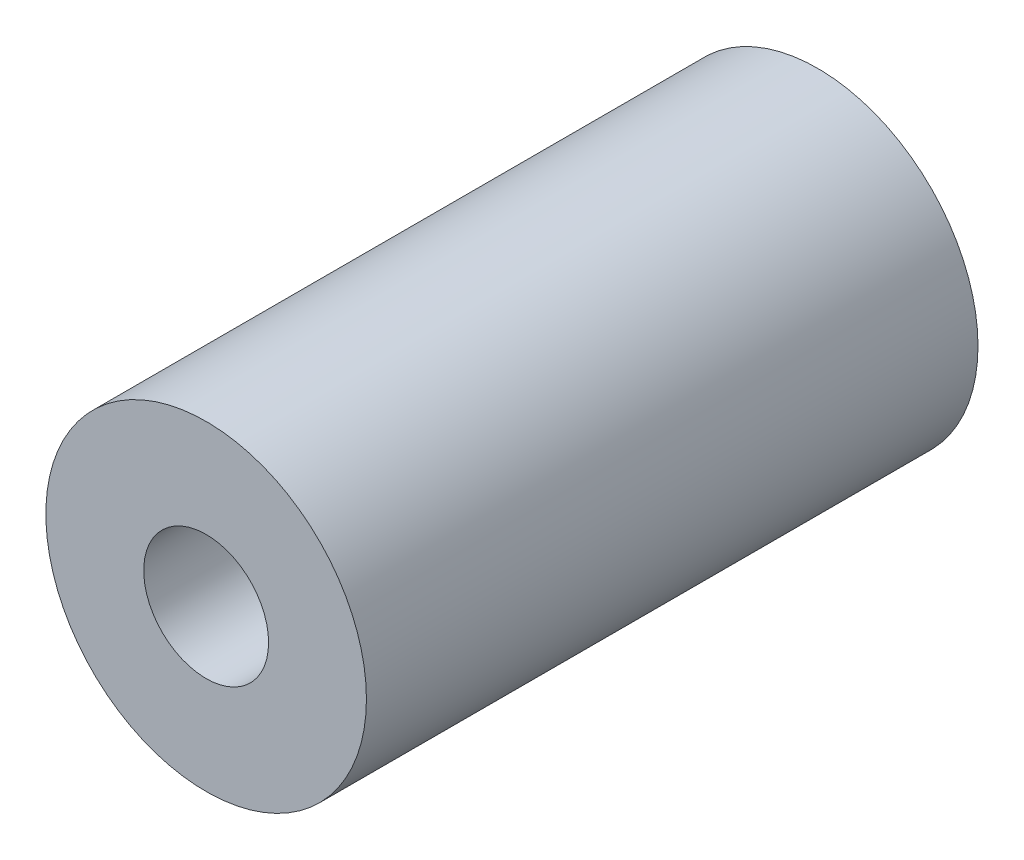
ISO-10303-21;
HEADER;
FILE_DESCRIPTION(('STEP AP214'),'2;1');
FILE_NAME('part.step','',(''),(''),'','','');
FILE_SCHEMA(('AUTOMOTIVE_DESIGN { 1 0 10303 214 1 1 1 1 }'));
ENDSEC;
DATA;
#1=APPLICATION_CONTEXT('core data for automotive mechanical design processes');
#2=APPLICATION_PROTOCOL_DEFINITION('international standard','automotive_design',2000,#1);
#3=PRODUCT_CONTEXT('',#1,'mechanical');
#4=PRODUCT('Part','Part','',(#3));
#5=PRODUCT_RELATED_PRODUCT_CATEGORY('part','',(#4));
#6=PRODUCT_DEFINITION_FORMATION('','',#4);
#7=PRODUCT_DEFINITION_CONTEXT('part definition',#1,'design');
#8=PRODUCT_DEFINITION('design','',#6,#7);
#9=PRODUCT_DEFINITION_SHAPE('','',#8);
#10=(LENGTH_UNIT() NAMED_UNIT(*) SI_UNIT(.MILLI.,.METRE.));
#11=(NAMED_UNIT(*) PLANE_ANGLE_UNIT() SI_UNIT($,.RADIAN.));
#12=(NAMED_UNIT(*) SI_UNIT($,.STERADIAN.) SOLID_ANGLE_UNIT());
#13=UNCERTAINTY_MEASURE_WITH_UNIT(LENGTH_MEASURE(1.E-05),#10,'distance_accuracy_value','');
#14=(GEOMETRIC_REPRESENTATION_CONTEXT(3) GLOBAL_UNCERTAINTY_ASSIGNED_CONTEXT((#13)) GLOBAL_UNIT_ASSIGNED_CONTEXT((#10,
#11,#12)) REPRESENTATION_CONTEXT('',''));
#15=CARTESIAN_POINT('',(0.,0.,0.));
#16=DIRECTION('',(0.,0.,1.));
#17=DIRECTION('',(1.,0.,0.));
#18=AXIS2_PLACEMENT_3D('',#15,#16,#17);
#19=CARTESIAN_POINT('',(0.,0.,12.5));
#20=DIRECTION('',(0.,0.,1.));
#21=DIRECTION('',(1.,0.,0.));
#22=AXIS2_PLACEMENT_3D('',#19,#20,#21);
#23=PLANE('',#22);
#24=CARTESIAN_POINT('',(0.,0.,12.5));
#25=DIRECTION('',(0.,0.,1.));
#26=DIRECTION('',(1.,0.,0.));
#27=AXIS2_PLACEMENT_3D('',#24,#25,#26);
#28=CIRCLE('',#27,6.5527);
#29=CARTESIAN_POINT('',(6.5527,0.,12.5));
#30=VERTEX_POINT('',#29);
#31=EDGE_CURVE('E10',#30,#30,#28,.T.);
#32=ORIENTED_EDGE('',*,*,#31,.T.);
#33=EDGE_LOOP('',(#32));
#34=FACE_BOUND('',#33,.T.);
#35=CARTESIAN_POINT('',(0.,0.,12.5));
#36=DIRECTION('',(0.,0.,1.));
#37=DIRECTION('',(1.,0.,0.));
#38=AXIS2_PLACEMENT_3D('',#35,#36,#37);
#39=CIRCLE('',#38,2.5527);
#40=CARTESIAN_POINT('',(2.5527,0.,12.5));
#41=VERTEX_POINT('',#40);
#42=EDGE_CURVE('E43',#41,#41,#39,.T.);
#43=ORIENTED_EDGE('',*,*,#42,.F.);
#44=EDGE_LOOP('',(#43));
#45=FACE_BOUND('',#44,.T.);
#46=ADVANCED_FACE('F32',(#34,#45),#23,.T.);
#47=CARTESIAN_POINT('',(0.,0.,-12.5));
#48=DIRECTION('',(0.,0.,1.));
#49=DIRECTION('',(1.,0.,0.));
#50=AXIS2_PLACEMENT_3D('',#47,#48,#49);
#51=PLANE('',#50);
#52=CARTESIAN_POINT('',(0.,0.,-12.5));
#53=DIRECTION('',(0.,0.,1.));
#54=DIRECTION('',(1.,0.,0.));
#55=AXIS2_PLACEMENT_3D('',#52,#53,#54);
#56=CIRCLE('',#55,6.5527);
#57=CARTESIAN_POINT('',(6.5527,0.,-12.5));
#58=VERTEX_POINT('',#57);
#59=EDGE_CURVE('E36',#58,#58,#56,.T.);
#60=ORIENTED_EDGE('',*,*,#59,.F.);
#61=EDGE_LOOP('',(#60));
#62=FACE_BOUND('',#61,.T.);
#63=CARTESIAN_POINT('',(0.,0.,-12.5));
#64=DIRECTION('',(0.,0.,1.));
#65=DIRECTION('',(1.,0.,0.));
#66=AXIS2_PLACEMENT_3D('',#63,#64,#65);
#67=CIRCLE('',#66,2.5527);
#68=CARTESIAN_POINT('',(2.5527,0.,-12.5));
#69=VERTEX_POINT('',#68);
#70=EDGE_CURVE('E45',#69,#69,#67,.T.);
#71=ORIENTED_EDGE('',*,*,#70,.T.);
#72=EDGE_LOOP('',(#71));
#73=FACE_BOUND('',#72,.T.);
#74=ADVANCED_FACE('F55',(#62,#73),#51,.F.);
#75=CARTESIAN_POINT('',(0.,0.,12.5));
#76=DIRECTION('',(0.,0.,-1.));
#77=DIRECTION('',(-1.,0.,0.));
#78=AXIS2_PLACEMENT_3D('',#75,#76,#77);
#79=CYLINDRICAL_SURFACE('',#78,6.5527);
#80=ORIENTED_EDGE('',*,*,#31,.F.);
#81=EDGE_LOOP('',(#80));
#82=FACE_BOUND('',#81,.T.);
#83=ORIENTED_EDGE('',*,*,#59,.T.);
#84=EDGE_LOOP('',(#83));
#85=FACE_BOUND('',#84,.T.);
#86=ADVANCED_FACE('F34',(#82,#85),#79,.T.);
#87=CARTESIAN_POINT('',(0.,0.,12.5));
#88=DIRECTION('',(0.,0.,-1.));
#89=DIRECTION('',(-1.,0.,0.));
#90=AXIS2_PLACEMENT_3D('',#87,#88,#89);
#91=CYLINDRICAL_SURFACE('',#90,2.5527);
#92=ORIENTED_EDGE('',*,*,#42,.T.);
#93=EDGE_LOOP('',(#92));
#94=FACE_BOUND('',#93,.T.);
#95=ORIENTED_EDGE('',*,*,#70,.F.);
#96=EDGE_LOOP('',(#95));
#97=FACE_BOUND('',#96,.T.);
#98=ADVANCED_FACE('F51',(#94,#97),#91,.F.);
#99=CLOSED_SHELL('',(#46,#74,#86,#98));
#100=MANIFOLD_SOLID_BREP('B2',#99);
#101=ADVANCED_BREP_SHAPE_REPRESENTATION('',(#18,#100),#14);
#102=SHAPE_DEFINITION_REPRESENTATION(#9,#101);
ENDSEC;
END-ISO-10303-21;
